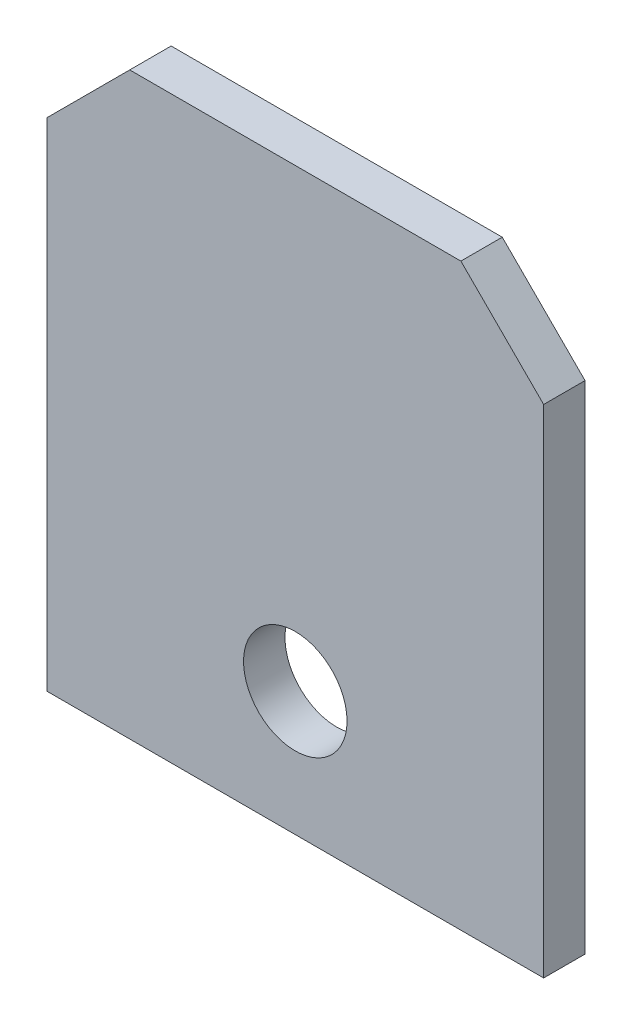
ISO-10303-21;
HEADER;
FILE_DESCRIPTION(('STEP AP214'),'2;1');
FILE_NAME('part.step','',(''),(''),'','','');
FILE_SCHEMA(('AUTOMOTIVE_DESIGN { 1 0 10303 214 1 1 1 1 }'));
ENDSEC;
DATA;
#1=APPLICATION_CONTEXT('core data for automotive mechanical design processes');
#2=APPLICATION_PROTOCOL_DEFINITION('international standard','automotive_design',2000,#1);
#3=PRODUCT_CONTEXT('',#1,'mechanical');
#4=PRODUCT('Part','Part','',(#3));
#5=PRODUCT_RELATED_PRODUCT_CATEGORY('part','',(#4));
#6=PRODUCT_DEFINITION_FORMATION('','',#4);
#7=PRODUCT_DEFINITION_CONTEXT('part definition',#1,'design');
#8=PRODUCT_DEFINITION('design','',#6,#7);
#9=PRODUCT_DEFINITION_SHAPE('','',#8);
#10=(LENGTH_UNIT() NAMED_UNIT(*) SI_UNIT(.MILLI.,.METRE.));
#11=(NAMED_UNIT(*) PLANE_ANGLE_UNIT() SI_UNIT($,.RADIAN.));
#12=(NAMED_UNIT(*) SI_UNIT($,.STERADIAN.) SOLID_ANGLE_UNIT());
#13=UNCERTAINTY_MEASURE_WITH_UNIT(LENGTH_MEASURE(1.E-05),#10,'distance_accuracy_value','');
#14=(GEOMETRIC_REPRESENTATION_CONTEXT(3) GLOBAL_UNCERTAINTY_ASSIGNED_CONTEXT((#13)) GLOBAL_UNIT_ASSIGNED_CONTEXT((#10,
#11,#12)) REPRESENTATION_CONTEXT('',''));
#15=CARTESIAN_POINT('',(0.,0.,0.));
#16=DIRECTION('',(0.,0.,1.));
#17=DIRECTION('',(1.,0.,0.));
#18=AXIS2_PLACEMENT_3D('',#15,#16,#17);
#19=CARTESIAN_POINT('',(0.,0.,6.35));
#20=DIRECTION('',(1.,0.,0.));
#21=DIRECTION('',(0.,1.,0.));
#22=AXIS2_PLACEMENT_3D('',#19,#20,#21);
#23=PLANE('',#22);
#24=DIRECTION('',(0.,-1.,0.));
#25=VECTOR('',#24,1.);
#26=CARTESIAN_POINT('',(0.,0.,6.35));
#27=LINE('',#26,#25);
#28=CARTESIAN_POINT('',(0.,-12.7,6.35));
#29=VERTEX_POINT('',#28);
#30=CARTESIAN_POINT('',(0.,-88.9,6.35));
#31=VERTEX_POINT('',#30);
#32=EDGE_CURVE('E125',#29,#31,#27,.T.);
#33=ORIENTED_EDGE('',*,*,#32,.F.);
#34=DIRECTION('',(0.,0.,-1.));
#35=VECTOR('',#34,1.);
#36=CARTESIAN_POINT('',(0.,-12.7,6.35));
#37=LINE('',#36,#35);
#38=CARTESIAN_POINT('',(0.,-12.7,0.));
#39=VERTEX_POINT('',#38);
#40=EDGE_CURVE('E86',#29,#39,#37,.T.);
#41=ORIENTED_EDGE('',*,*,#40,.T.);
#42=DIRECTION('',(0.,-1.,0.));
#43=VECTOR('',#42,1.);
#44=CARTESIAN_POINT('',(0.,0.,0.));
#45=LINE('',#44,#43);
#46=CARTESIAN_POINT('',(0.,-88.9,0.));
#47=VERTEX_POINT('',#46);
#48=EDGE_CURVE('E80',#39,#47,#45,.T.);
#49=ORIENTED_EDGE('',*,*,#48,.T.);
#50=DIRECTION('',(0.,0.,-1.));
#51=VECTOR('',#50,1.);
#52=CARTESIAN_POINT('',(0.,-88.9,6.35));
#53=LINE('',#52,#51);
#54=EDGE_CURVE('E84',#31,#47,#53,.T.);
#55=ORIENTED_EDGE('',*,*,#54,.F.);
#56=EDGE_LOOP('',(#33,#41,#49,#55));
#57=FACE_BOUND('',#56,.T.);
#58=ADVANCED_FACE('F27',(#57),#23,.F.);
#59=CARTESIAN_POINT('',(0.,-88.9,6.35));
#60=DIRECTION('',(0.,1.,0.));
#61=DIRECTION('',(0.,0.,1.));
#62=AXIS2_PLACEMENT_3D('',#59,#60,#61);
#63=PLANE('',#62);
#64=DIRECTION('',(1.,0.,0.));
#65=VECTOR('',#64,1.);
#66=CARTESIAN_POINT('',(0.,-88.9,0.));
#67=LINE('',#66,#65);
#68=CARTESIAN_POINT('',(76.2,-88.9,0.));
#69=VERTEX_POINT('',#68);
#70=EDGE_CURVE('E88',#47,#69,#67,.T.);
#71=ORIENTED_EDGE('',*,*,#70,.T.);
#72=DIRECTION('',(0.,0.,-1.));
#73=VECTOR('',#72,1.);
#74=CARTESIAN_POINT('',(76.2,-88.9,6.35));
#75=LINE('',#74,#73);
#76=CARTESIAN_POINT('',(76.2,-88.9,6.35));
#77=VERTEX_POINT('',#76);
#78=EDGE_CURVE('E100',#77,#69,#75,.T.);
#79=ORIENTED_EDGE('',*,*,#78,.F.);
#80=DIRECTION('',(1.,0.,0.));
#81=VECTOR('',#80,1.);
#82=CARTESIAN_POINT('',(0.,-88.9,6.35));
#83=LINE('',#82,#81);
#84=EDGE_CURVE('E99',#31,#77,#83,.T.);
#85=ORIENTED_EDGE('',*,*,#84,.F.);
#86=ORIENTED_EDGE('',*,*,#54,.T.);
#87=EDGE_LOOP('',(#71,#79,#85,#86));
#88=FACE_BOUND('',#87,.T.);
#89=ADVANCED_FACE('F98',(#88),#63,.F.);
#90=CARTESIAN_POINT('',(76.2,0.,6.35));
#91=DIRECTION('',(-1.,0.,0.));
#92=DIRECTION('',(0.,-1.,0.));
#93=AXIS2_PLACEMENT_3D('',#90,#91,#92);
#94=PLANE('',#93);
#95=DIRECTION('',(0.,1.,0.));
#96=VECTOR('',#95,1.);
#97=CARTESIAN_POINT('',(76.2,0.,0.));
#98=LINE('',#97,#96);
#99=CARTESIAN_POINT('',(76.2,-12.7000000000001,0.));
#100=VERTEX_POINT('',#99);
#101=EDGE_CURVE('E92',#69,#100,#98,.T.);
#102=ORIENTED_EDGE('',*,*,#101,.T.);
#103=DIRECTION('',(0.,0.,1.));
#104=VECTOR('',#103,1.);
#105=CARTESIAN_POINT('',(76.2,-12.7000000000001,6.35));
#106=LINE('',#105,#104);
#107=CARTESIAN_POINT('',(76.2,-12.7000000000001,6.35));
#108=VERTEX_POINT('',#107);
#109=EDGE_CURVE('E34',#100,#108,#106,.T.);
#110=ORIENTED_EDGE('',*,*,#109,.T.);
#111=DIRECTION('',(0.,1.,0.));
#112=VECTOR('',#111,1.);
#113=CARTESIAN_POINT('',(76.2,0.,6.35));
#114=LINE('',#113,#112);
#115=EDGE_CURVE('E131',#77,#108,#114,.T.);
#116=ORIENTED_EDGE('',*,*,#115,.F.);
#117=ORIENTED_EDGE('',*,*,#78,.T.);
#118=EDGE_LOOP('',(#102,#110,#116,#117));
#119=FACE_BOUND('',#118,.T.);
#120=ADVANCED_FACE('F153',(#119),#94,.F.);
#121=CARTESIAN_POINT('',(0.,0.,6.35));
#122=DIRECTION('',(0.,-1.,0.));
#123=DIRECTION('',(0.,0.,-1.));
#124=AXIS2_PLACEMENT_3D('',#121,#122,#123);
#125=PLANE('',#124);
#126=DIRECTION('',(-1.,0.,0.));
#127=VECTOR('',#126,1.);
#128=CARTESIAN_POINT('',(0.,0.,6.35));
#129=LINE('',#128,#127);
#130=CARTESIAN_POINT('',(63.4999999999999,0.,6.35));
#131=VERTEX_POINT('',#130);
#132=CARTESIAN_POINT('',(12.7000000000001,0.,6.35));
#133=VERTEX_POINT('',#132);
#134=EDGE_CURVE('E104',#131,#133,#129,.T.);
#135=ORIENTED_EDGE('',*,*,#134,.F.);
#136=DIRECTION('',(0.,0.,-1.));
#137=VECTOR('',#136,1.);
#138=CARTESIAN_POINT('',(63.5,0.,6.35));
#139=LINE('',#138,#137);
#140=CARTESIAN_POINT('',(63.4999999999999,0.,0.));
#141=VERTEX_POINT('',#140);
#142=EDGE_CURVE('E114',#131,#141,#139,.T.);
#143=ORIENTED_EDGE('',*,*,#142,.T.);
#144=DIRECTION('',(-1.,0.,0.));
#145=VECTOR('',#144,1.);
#146=CARTESIAN_POINT('',(0.,0.,0.));
#147=LINE('',#146,#145);
#148=CARTESIAN_POINT('',(12.7000000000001,0.,0.));
#149=VERTEX_POINT('',#148);
#150=EDGE_CURVE('E121',#141,#149,#147,.T.);
#151=ORIENTED_EDGE('',*,*,#150,.T.);
#152=DIRECTION('',(0.,0.,1.));
#153=VECTOR('',#152,1.);
#154=CARTESIAN_POINT('',(12.7000000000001,0.,6.35));
#155=LINE('',#154,#153);
#156=EDGE_CURVE('E109',#149,#133,#155,.T.);
#157=ORIENTED_EDGE('',*,*,#156,.T.);
#158=EDGE_LOOP('',(#135,#143,#151,#157));
#159=FACE_BOUND('',#158,.T.);
#160=ADVANCED_FACE('F120',(#159),#125,.F.);
#161=CARTESIAN_POINT('',(0.,-88.9,6.35));
#162=DIRECTION('',(0.,0.,1.));
#163=DIRECTION('',(1.,0.,0.));
#164=AXIS2_PLACEMENT_3D('',#161,#162,#163);
#165=PLANE('',#164);
#166=CARTESIAN_POINT('',(38.1,-69.85,6.35));
#167=DIRECTION('',(0.,0.,1.));
#168=DIRECTION('',(1.,0.,0.));
#169=AXIS2_PLACEMENT_3D('',#166,#167,#168);
#170=CIRCLE('',#169,7.93750000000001);
#171=CARTESIAN_POINT('',(46.0375,-69.85,6.35));
#172=VERTEX_POINT('',#171);
#173=EDGE_CURVE('E169',#172,#172,#170,.T.);
#174=ORIENTED_EDGE('',*,*,#173,.F.);
#175=EDGE_LOOP('',(#174));
#176=FACE_BOUND('',#175,.T.);
#177=ORIENTED_EDGE('',*,*,#115,.T.);
#178=DIRECTION('',(0.707106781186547,-0.707106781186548,0.));
#179=VECTOR('',#178,1.);
#180=CARTESIAN_POINT('',(76.2,-12.7000000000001,6.35));
#181=LINE('',#180,#179);
#182=EDGE_CURVE('E11',#108,#131,#181,.F.);
#183=ORIENTED_EDGE('',*,*,#182,.T.);
#184=ORIENTED_EDGE('',*,*,#134,.T.);
#185=DIRECTION('',(0.707106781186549,0.707106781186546,0.));
#186=VECTOR('',#185,1.);
#187=CARTESIAN_POINT('',(-38.1,-50.7999999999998,6.35));
#188=LINE('',#187,#186);
#189=EDGE_CURVE('E112',#133,#29,#188,.F.);
#190=ORIENTED_EDGE('',*,*,#189,.T.);
#191=ORIENTED_EDGE('',*,*,#32,.T.);
#192=ORIENTED_EDGE('',*,*,#84,.T.);
#193=EDGE_LOOP('',(#177,#183,#184,#190,#191,#192));
#194=FACE_BOUND('',#193,.T.);
#195=ADVANCED_FACE('F133',(#176,#194),#165,.T.);
#196=CARTESIAN_POINT('',(0.,-88.9,0.));
#197=DIRECTION('',(0.,0.,1.));
#198=DIRECTION('',(1.,0.,0.));
#199=AXIS2_PLACEMENT_3D('',#196,#197,#198);
#200=PLANE('',#199);
#201=CARTESIAN_POINT('',(38.1,-69.85,0.));
#202=DIRECTION('',(0.,0.,1.));
#203=DIRECTION('',(1.,0.,0.));
#204=AXIS2_PLACEMENT_3D('',#201,#202,#203);
#205=CIRCLE('',#204,7.93750000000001);
#206=CARTESIAN_POINT('',(46.0375,-69.85,0.));
#207=VERTEX_POINT('',#206);
#208=EDGE_CURVE('E89',#207,#207,#205,.T.);
#209=ORIENTED_EDGE('',*,*,#208,.T.);
#210=EDGE_LOOP('',(#209));
#211=FACE_BOUND('',#210,.T.);
#212=ORIENTED_EDGE('',*,*,#150,.F.);
#213=DIRECTION('',(-0.707106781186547,0.707106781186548,0.));
#214=VECTOR('',#213,1.);
#215=CARTESIAN_POINT('',(63.5,0.,0.));
#216=LINE('',#215,#214);
#217=EDGE_CURVE('E48',#141,#100,#216,.F.);
#218=ORIENTED_EDGE('',*,*,#217,.T.);
#219=ORIENTED_EDGE('',*,*,#101,.F.);
#220=ORIENTED_EDGE('',*,*,#70,.F.);
#221=ORIENTED_EDGE('',*,*,#48,.F.);
#222=DIRECTION('',(-0.707106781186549,-0.707106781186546,0.));
#223=VECTOR('',#222,1.);
#224=CARTESIAN_POINT('',(0.,-12.7,0.));
#225=LINE('',#224,#223);
#226=EDGE_CURVE('E102',#39,#149,#225,.F.);
#227=ORIENTED_EDGE('',*,*,#226,.T.);
#228=EDGE_LOOP('',(#212,#218,#219,#220,#221,#227));
#229=FACE_BOUND('',#228,.T.);
#230=ADVANCED_FACE('F91',(#211,#229),#200,.F.);
#231=CARTESIAN_POINT('',(38.1,-69.85,0.));
#232=DIRECTION('',(0.,0.,1.));
#233=DIRECTION('',(1.,0.,0.));
#234=AXIS2_PLACEMENT_3D('',#231,#232,#233);
#235=CYLINDRICAL_SURFACE('',#234,7.93750000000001);
#236=ORIENTED_EDGE('',*,*,#208,.F.);
#237=EDGE_LOOP('',(#236));
#238=FACE_BOUND('',#237,.T.);
#239=ORIENTED_EDGE('',*,*,#173,.T.);
#240=EDGE_LOOP('',(#239));
#241=FACE_BOUND('',#240,.T.);
#242=ADVANCED_FACE('F139',(#238,#241),#235,.F.);
#243=CARTESIAN_POINT('',(0.,-12.7,6.35));
#244=DIRECTION('',(0.707106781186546,-0.707106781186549,0.));
#245=DIRECTION('',(0.707106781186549,0.707106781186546,0.));
#246=AXIS2_PLACEMENT_3D('',#243,#244,#245);
#247=PLANE('',#246);
#248=ORIENTED_EDGE('',*,*,#189,.F.);
#249=ORIENTED_EDGE('',*,*,#156,.F.);
#250=ORIENTED_EDGE('',*,*,#226,.F.);
#251=ORIENTED_EDGE('',*,*,#40,.F.);
#252=EDGE_LOOP('',(#248,#249,#250,#251));
#253=FACE_BOUND('',#252,.T.);
#254=ADVANCED_FACE('F136',(#253),#247,.F.);
#255=CARTESIAN_POINT('',(63.5,0.,6.35));
#256=DIRECTION('',(-0.707106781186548,-0.707106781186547,0.));
#257=DIRECTION('',(0.707106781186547,-0.707106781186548,0.));
#258=AXIS2_PLACEMENT_3D('',#255,#256,#257);
#259=PLANE('',#258);
#260=ORIENTED_EDGE('',*,*,#182,.F.);
#261=ORIENTED_EDGE('',*,*,#109,.F.);
#262=ORIENTED_EDGE('',*,*,#217,.F.);
#263=ORIENTED_EDGE('',*,*,#142,.F.);
#264=EDGE_LOOP('',(#260,#261,#262,#263));
#265=FACE_BOUND('',#264,.T.);
#266=ADVANCED_FACE('F138',(#265),#259,.F.);
#267=CLOSED_SHELL('',(#58,#89,#120,#160,#195,#230,#242,#254,#266));
#268=MANIFOLD_SOLID_BREP('B2',#267);
#269=ADVANCED_BREP_SHAPE_REPRESENTATION('',(#18,#268),#14);
#270=SHAPE_DEFINITION_REPRESENTATION(#9,#269);
ENDSEC;
END-ISO-10303-21;
